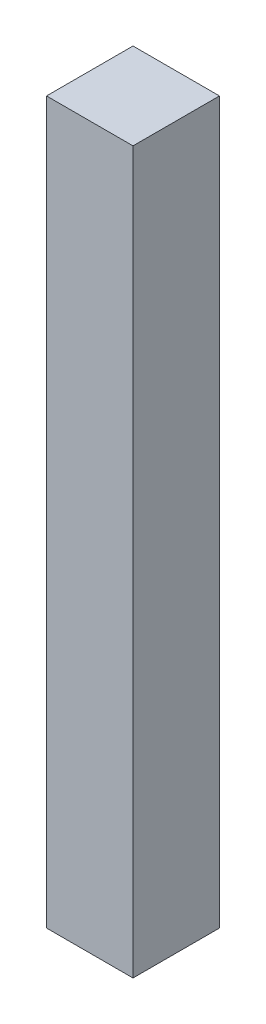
ISO-10303-21;
HEADER;
FILE_DESCRIPTION(('STEP AP214'),'2;1');
FILE_NAME('part.step','',(''),(''),'','','');
FILE_SCHEMA(('AUTOMOTIVE_DESIGN { 1 0 10303 214 1 1 1 1 }'));
ENDSEC;
DATA;
#1=APPLICATION_CONTEXT('core data for automotive mechanical design processes');
#2=APPLICATION_PROTOCOL_DEFINITION('international standard','automotive_design',2000,#1);
#3=PRODUCT_CONTEXT('',#1,'mechanical');
#4=PRODUCT('Part','Part','',(#3));
#5=PRODUCT_RELATED_PRODUCT_CATEGORY('part','',(#4));
#6=PRODUCT_DEFINITION_FORMATION('','',#4);
#7=PRODUCT_DEFINITION_CONTEXT('part definition',#1,'design');
#8=PRODUCT_DEFINITION('design','',#6,#7);
#9=PRODUCT_DEFINITION_SHAPE('','',#8);
#10=(LENGTH_UNIT() NAMED_UNIT(*) SI_UNIT(.MILLI.,.METRE.));
#11=(NAMED_UNIT(*) PLANE_ANGLE_UNIT() SI_UNIT($,.RADIAN.));
#12=(NAMED_UNIT(*) SI_UNIT($,.STERADIAN.) SOLID_ANGLE_UNIT());
#13=UNCERTAINTY_MEASURE_WITH_UNIT(LENGTH_MEASURE(1.E-05),#10,'distance_accuracy_value','');
#14=(GEOMETRIC_REPRESENTATION_CONTEXT(3) GLOBAL_UNCERTAINTY_ASSIGNED_CONTEXT((#13)) GLOBAL_UNIT_ASSIGNED_CONTEXT((#10,
#11,#12)) REPRESENTATION_CONTEXT('',''));
#15=CARTESIAN_POINT('',(0.,0.,0.));
#16=DIRECTION('',(0.,0.,1.));
#17=DIRECTION('',(1.,0.,0.));
#18=AXIS2_PLACEMENT_3D('',#15,#16,#17);
#19=CARTESIAN_POINT('',(120.,2000.,-120.));
#20=DIRECTION('',(-1.,0.,0.));
#21=DIRECTION('',(0.,0.,1.));
#22=AXIS2_PLACEMENT_3D('',#19,#20,#21);
#23=PLANE('',#22);
#24=DIRECTION('',(0.,0.,-1.));
#25=VECTOR('',#24,1.);
#26=CARTESIAN_POINT('',(120.,0.,-120.));
#27=LINE('',#26,#25);
#28=CARTESIAN_POINT('',(120.,0.,120.));
#29=VERTEX_POINT('',#28);
#30=CARTESIAN_POINT('',(120.,0.,-120.));
#31=VERTEX_POINT('',#30);
#32=EDGE_CURVE('E95',#29,#31,#27,.T.);
#33=ORIENTED_EDGE('',*,*,#32,.T.);
#34=DIRECTION('',(0.,-1.,0.));
#35=VECTOR('',#34,1.);
#36=CARTESIAN_POINT('',(120.,2000.,-120.));
#37=LINE('',#36,#35);
#38=CARTESIAN_POINT('',(120.,2000.,-120.));
#39=VERTEX_POINT('',#38);
#40=EDGE_CURVE('E11',#39,#31,#37,.T.);
#41=ORIENTED_EDGE('',*,*,#40,.F.);
#42=DIRECTION('',(0.,0.,-1.));
#43=VECTOR('',#42,1.);
#44=CARTESIAN_POINT('',(120.,2000.,-120.));
#45=LINE('',#44,#43);
#46=CARTESIAN_POINT('',(120.,2000.,120.));
#47=VERTEX_POINT('',#46);
#48=EDGE_CURVE('E83',#47,#39,#45,.T.);
#49=ORIENTED_EDGE('',*,*,#48,.F.);
#50=DIRECTION('',(0.,-1.,0.));
#51=VECTOR('',#50,1.);
#52=CARTESIAN_POINT('',(120.,2000.,120.));
#53=LINE('',#52,#51);
#54=EDGE_CURVE('E91',#47,#29,#53,.T.);
#55=ORIENTED_EDGE('',*,*,#54,.T.);
#56=EDGE_LOOP('',(#33,#41,#49,#55));
#57=FACE_BOUND('',#56,.T.);
#58=ADVANCED_FACE('F32',(#57),#23,.F.);
#59=CARTESIAN_POINT('',(-120.,2000.,-120.));
#60=DIRECTION('',(0.,0.,1.));
#61=DIRECTION('',(1.,0.,0.));
#62=AXIS2_PLACEMENT_3D('',#59,#60,#61);
#63=PLANE('',#62);
#64=DIRECTION('',(-1.,0.,0.));
#65=VECTOR('',#64,1.);
#66=CARTESIAN_POINT('',(-120.,0.,-120.));
#67=LINE('',#66,#65);
#68=CARTESIAN_POINT('',(-120.,0.,-120.));
#69=VERTEX_POINT('',#68);
#70=EDGE_CURVE('E87',#31,#69,#67,.T.);
#71=ORIENTED_EDGE('',*,*,#70,.T.);
#72=DIRECTION('',(0.,-1.,0.));
#73=VECTOR('',#72,1.);
#74=CARTESIAN_POINT('',(-120.,2000.,-120.));
#75=LINE('',#74,#73);
#76=CARTESIAN_POINT('',(-120.,2000.,-120.));
#77=VERTEX_POINT('',#76);
#78=EDGE_CURVE('E40',#77,#69,#75,.T.);
#79=ORIENTED_EDGE('',*,*,#78,.F.);
#80=DIRECTION('',(-1.,0.,0.));
#81=VECTOR('',#80,1.);
#82=CARTESIAN_POINT('',(-120.,2000.,-120.));
#83=LINE('',#82,#81);
#84=EDGE_CURVE('E78',#39,#77,#83,.T.);
#85=ORIENTED_EDGE('',*,*,#84,.F.);
#86=ORIENTED_EDGE('',*,*,#40,.T.);
#87=EDGE_LOOP('',(#71,#79,#85,#86));
#88=FACE_BOUND('',#87,.T.);
#89=ADVANCED_FACE('F86',(#88),#63,.F.);
#90=CARTESIAN_POINT('',(-120.,2000.,-120.));
#91=DIRECTION('',(1.,0.,0.));
#92=DIRECTION('',(0.,0.,-1.));
#93=AXIS2_PLACEMENT_3D('',#90,#91,#92);
#94=PLANE('',#93);
#95=DIRECTION('',(0.,0.,1.));
#96=VECTOR('',#95,1.);
#97=CARTESIAN_POINT('',(-120.,0.,-120.));
#98=LINE('',#97,#96);
#99=CARTESIAN_POINT('',(-120.,0.,120.));
#100=VERTEX_POINT('',#99);
#101=EDGE_CURVE('E65',#69,#100,#98,.T.);
#102=ORIENTED_EDGE('',*,*,#101,.T.);
#103=DIRECTION('',(0.,-1.,0.));
#104=VECTOR('',#103,1.);
#105=CARTESIAN_POINT('',(-120.,2000.,120.));
#106=LINE('',#105,#104);
#107=CARTESIAN_POINT('',(-120.,2000.,120.));
#108=VERTEX_POINT('',#107);
#109=EDGE_CURVE('E88',#108,#100,#106,.T.);
#110=ORIENTED_EDGE('',*,*,#109,.F.);
#111=DIRECTION('',(0.,0.,1.));
#112=VECTOR('',#111,1.);
#113=CARTESIAN_POINT('',(-120.,2000.,-120.));
#114=LINE('',#113,#112);
#115=EDGE_CURVE('E81',#77,#108,#114,.T.);
#116=ORIENTED_EDGE('',*,*,#115,.F.);
#117=ORIENTED_EDGE('',*,*,#78,.T.);
#118=EDGE_LOOP('',(#102,#110,#116,#117));
#119=FACE_BOUND('',#118,.T.);
#120=ADVANCED_FACE('F89',(#119),#94,.F.);
#121=CARTESIAN_POINT('',(-120.,2000.,120.));
#122=DIRECTION('',(0.,0.,-1.));
#123=DIRECTION('',(-1.,0.,0.));
#124=AXIS2_PLACEMENT_3D('',#121,#122,#123);
#125=PLANE('',#124);
#126=DIRECTION('',(1.,0.,0.));
#127=VECTOR('',#126,1.);
#128=CARTESIAN_POINT('',(-120.,0.,120.));
#129=LINE('',#128,#127);
#130=EDGE_CURVE('E71',#100,#29,#129,.T.);
#131=ORIENTED_EDGE('',*,*,#130,.T.);
#132=ORIENTED_EDGE('',*,*,#54,.F.);
#133=DIRECTION('',(1.,0.,0.));
#134=VECTOR('',#133,1.);
#135=CARTESIAN_POINT('',(-120.,2000.,120.));
#136=LINE('',#135,#134);
#137=EDGE_CURVE('E48',#108,#47,#136,.T.);
#138=ORIENTED_EDGE('',*,*,#137,.F.);
#139=ORIENTED_EDGE('',*,*,#109,.T.);
#140=EDGE_LOOP('',(#131,#132,#138,#139));
#141=FACE_BOUND('',#140,.T.);
#142=ADVANCED_FACE('F102',(#141),#125,.F.);
#143=CARTESIAN_POINT('',(0.,2000.,0.));
#144=DIRECTION('',(0.,1.,0.));
#145=DIRECTION('',(0.,0.,1.));
#146=AXIS2_PLACEMENT_3D('',#143,#144,#145);
#147=PLANE('',#146);
#148=ORIENTED_EDGE('',*,*,#48,.T.);
#149=ORIENTED_EDGE('',*,*,#84,.T.);
#150=ORIENTED_EDGE('',*,*,#115,.T.);
#151=ORIENTED_EDGE('',*,*,#137,.T.);
#152=EDGE_LOOP('',(#148,#149,#150,#151));
#153=FACE_BOUND('',#152,.T.);
#154=ADVANCED_FACE('F79',(#153),#147,.T.);
#155=CARTESIAN_POINT('',(0.,0.,0.));
#156=DIRECTION('',(0.,1.,0.));
#157=DIRECTION('',(0.,0.,1.));
#158=AXIS2_PLACEMENT_3D('',#155,#156,#157);
#159=PLANE('',#158);
#160=ORIENTED_EDGE('',*,*,#32,.F.);
#161=ORIENTED_EDGE('',*,*,#130,.F.);
#162=ORIENTED_EDGE('',*,*,#101,.F.);
#163=ORIENTED_EDGE('',*,*,#70,.F.);
#164=EDGE_LOOP('',(#160,#161,#162,#163));
#165=FACE_BOUND('',#164,.T.);
#166=ADVANCED_FACE('F105',(#165),#159,.F.);
#167=CLOSED_SHELL('',(#58,#89,#120,#142,#154,#166));
#168=MANIFOLD_SOLID_BREP('B2',#167);
#169=ADVANCED_BREP_SHAPE_REPRESENTATION('',(#18,#168),#14);
#170=SHAPE_DEFINITION_REPRESENTATION(#9,#169);
ENDSEC;
END-ISO-10303-21;
